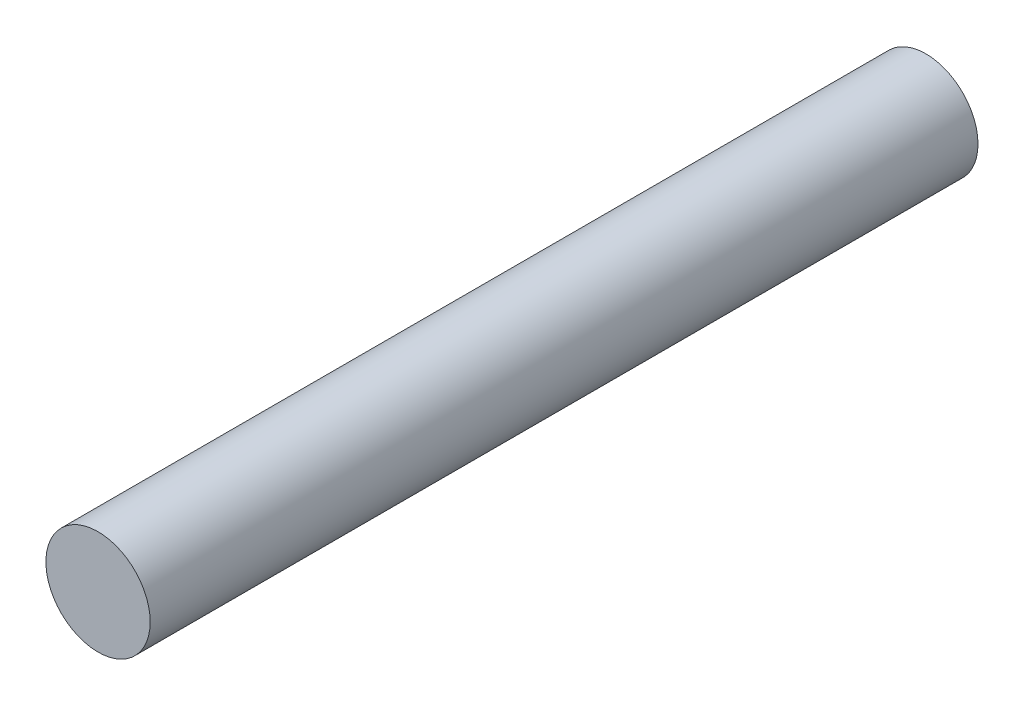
from build123d import *

# Parameters (mm, degrees)
SKETCH1_R           = 6.4
BOSS_EXTRUDE1_DEPTH = 101.6


with BuildPart() as part:
    # Sketch1 → Boss-Extrude1 (new body)
    with BuildSketch(Plane.XY):
        Circle(SKETCH1_R)
    extrude(amount=BOSS_EXTRUDE1_DEPTH)


solid = part.part
